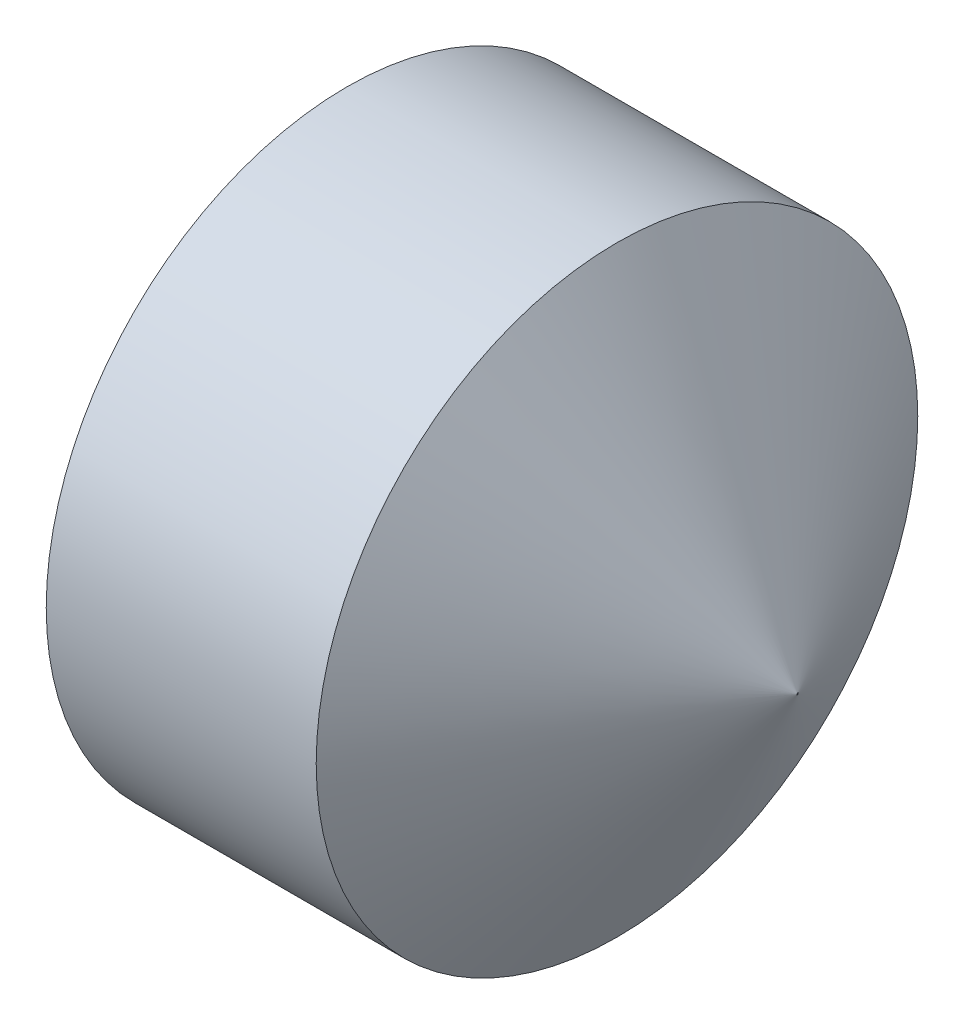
ISO-10303-21;
HEADER;
FILE_DESCRIPTION(('STEP AP214'),'2;1');
FILE_NAME('part.step','',(''),(''),'','','');
FILE_SCHEMA(('AUTOMOTIVE_DESIGN { 1 0 10303 214 1 1 1 1 }'));
ENDSEC;
DATA;
#1=APPLICATION_CONTEXT('core data for automotive mechanical design processes');
#2=APPLICATION_PROTOCOL_DEFINITION('international standard','automotive_design',2000,#1);
#3=PRODUCT_CONTEXT('',#1,'mechanical');
#4=PRODUCT('Part','Part','',(#3));
#5=PRODUCT_RELATED_PRODUCT_CATEGORY('part','',(#4));
#6=PRODUCT_DEFINITION_FORMATION('','',#4);
#7=PRODUCT_DEFINITION_CONTEXT('part definition',#1,'design');
#8=PRODUCT_DEFINITION('design','',#6,#7);
#9=PRODUCT_DEFINITION_SHAPE('','',#8);
#10=(LENGTH_UNIT() NAMED_UNIT(*) SI_UNIT(.MILLI.,.METRE.));
#11=(NAMED_UNIT(*) PLANE_ANGLE_UNIT() SI_UNIT($,.RADIAN.));
#12=(NAMED_UNIT(*) SI_UNIT($,.STERADIAN.) SOLID_ANGLE_UNIT());
#13=UNCERTAINTY_MEASURE_WITH_UNIT(LENGTH_MEASURE(1.E-05),#10,'distance_accuracy_value','');
#14=(GEOMETRIC_REPRESENTATION_CONTEXT(3) GLOBAL_UNCERTAINTY_ASSIGNED_CONTEXT((#13)) GLOBAL_UNIT_ASSIGNED_CONTEXT((#10,
#11,#12)) REPRESENTATION_CONTEXT('',''));
#15=CARTESIAN_POINT('',(0.,0.,0.));
#16=DIRECTION('',(0.,0.,1.));
#17=DIRECTION('',(1.,0.,0.));
#18=AXIS2_PLACEMENT_3D('',#15,#16,#17);
#19=CARTESIAN_POINT('',(0.,0.,0.));
#20=DIRECTION('',(-1.,0.,0.));
#21=DIRECTION('',(0.,0.,1.));
#22=AXIS2_PLACEMENT_3D('',#19,#20,#21);
#23=PLANE('',#22);
#24=CARTESIAN_POINT('',(0.,0.,0.));
#25=DIRECTION('',(-1.,0.,0.));
#26=DIRECTION('',(0.,0.,1.));
#27=AXIS2_PLACEMENT_3D('',#24,#25,#26);
#28=CIRCLE('',#27,2.055);
#29=CARTESIAN_POINT('',(0.,0.,2.055));
#30=VERTEX_POINT('',#29);
#31=EDGE_CURVE('E11',#30,#30,#28,.T.);
#32=ORIENTED_EDGE('',*,*,#31,.T.);
#33=EDGE_LOOP('',(#32));
#34=FACE_BOUND('',#33,.T.);
#35=DIRECTION('',(0.,0.,-1.));
#36=VECTOR('',#35,1.);
#37=CARTESIAN_POINT('',(0.,1.25,0.72168783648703));
#38=LINE('',#37,#36);
#39=CARTESIAN_POINT('',(0.,1.25,0.72168783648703));
#40=VERTEX_POINT('',#39);
#41=CARTESIAN_POINT('',(0.,1.25,-0.721687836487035));
#42=VERTEX_POINT('',#41);
#43=EDGE_CURVE('E124',#40,#42,#38,.T.);
#44=ORIENTED_EDGE('',*,*,#43,.F.);
#45=DIRECTION('',(0.,-0.866025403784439,0.5));
#46=VECTOR('',#45,1.);
#47=CARTESIAN_POINT('',(0.,1.25,0.72168783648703));
#48=LINE('',#47,#46);
#49=CARTESIAN_POINT('',(0.,0.,1.44337567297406));
#50=VERTEX_POINT('',#49);
#51=EDGE_CURVE('E46',#40,#50,#48,.T.);
#52=ORIENTED_EDGE('',*,*,#51,.T.);
#53=DIRECTION('',(0.,0.866025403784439,0.5));
#54=VECTOR('',#53,1.);
#55=CARTESIAN_POINT('',(0.,-1.25,0.72168783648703));
#56=LINE('',#55,#54);
#57=CARTESIAN_POINT('',(0.,-1.25,0.72168783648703));
#58=VERTEX_POINT('',#57);
#59=EDGE_CURVE('E115',#58,#50,#56,.T.);
#60=ORIENTED_EDGE('',*,*,#59,.F.);
#61=DIRECTION('',(0.,0.,-1.));
#62=VECTOR('',#61,1.);
#63=CARTESIAN_POINT('',(0.,-1.25,0.72168783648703));
#64=LINE('',#63,#62);
#65=CARTESIAN_POINT('',(0.,-1.25,-0.721687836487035));
#66=VERTEX_POINT('',#65);
#67=EDGE_CURVE('E118',#58,#66,#64,.T.);
#68=ORIENTED_EDGE('',*,*,#67,.T.);
#69=DIRECTION('',(0.,0.866025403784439,-0.5));
#70=VECTOR('',#69,1.);
#71=CARTESIAN_POINT('',(0.,-1.25,-0.721687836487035));
#72=LINE('',#71,#70);
#73=CARTESIAN_POINT('',(0.,0.,-1.44337567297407));
#74=VERTEX_POINT('',#73);
#75=EDGE_CURVE('E121',#66,#74,#72,.T.);
#76=ORIENTED_EDGE('',*,*,#75,.T.);
#77=DIRECTION('',(0.,-0.866025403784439,-0.5));
#78=VECTOR('',#77,1.);
#79=CARTESIAN_POINT('',(0.,1.25,-0.721687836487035));
#80=LINE('',#79,#78);
#81=EDGE_CURVE('E104',#42,#74,#80,.T.);
#82=ORIENTED_EDGE('',*,*,#81,.F.);
#83=EDGE_LOOP('',(#44,#52,#60,#68,#76,#82));
#84=FACE_BOUND('',#83,.T.);
#85=ADVANCED_FACE('F32',(#34,#84),#23,.T.);
#86=CARTESIAN_POINT('',(0.,0.,0.));
#87=DIRECTION('',(1.,0.,0.));
#88=DIRECTION('',(0.,0.,-1.));
#89=AXIS2_PLACEMENT_3D('',#86,#87,#88);
#90=CONICAL_SURFACE('',#89,2.055,1.0471975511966);
#91=CARTESIAN_POINT('',(0.256920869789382,0.,0.));
#92=DIRECTION('',(-1.,0.,0.));
#93=DIRECTION('',(0.,0.,1.));
#94=AXIS2_PLACEMENT_3D('',#91,#92,#93);
#95=CIRCLE('',#94,2.5);
#96=CARTESIAN_POINT('',(0.256920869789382,0.,2.5));
#97=VERTEX_POINT('',#96);
#98=EDGE_CURVE('E39',#97,#97,#95,.T.);
#99=ORIENTED_EDGE('',*,*,#98,.T.);
#100=EDGE_LOOP('',(#99));
#101=FACE_BOUND('',#100,.T.);
#102=ORIENTED_EDGE('',*,*,#31,.F.);
#103=EDGE_LOOP('',(#102));
#104=FACE_BOUND('',#103,.T.);
#105=ADVANCED_FACE('F141',(#101,#104),#90,.T.);
#106=CARTESIAN_POINT('',(-12.7,0.,0.));
#107=DIRECTION('',(-1.,0.,0.));
#108=DIRECTION('',(0.,0.,1.));
#109=AXIS2_PLACEMENT_3D('',#106,#107,#108);
#110=CYLINDRICAL_SURFACE('',#109,2.5);
#111=CARTESIAN_POINT('',(2.50085275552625,0.,0.));
#112=DIRECTION('',(-1.,0.,0.));
#113=DIRECTION('',(0.,0.,1.));
#114=AXIS2_PLACEMENT_3D('',#111,#112,#113);
#115=CIRCLE('',#114,2.5);
#116=CARTESIAN_POINT('',(2.50085275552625,0.,2.5));
#117=VERTEX_POINT('',#116);
#118=EDGE_CURVE('E136',#117,#117,#115,.T.);
#119=ORIENTED_EDGE('',*,*,#118,.T.);
#120=EDGE_LOOP('',(#119));
#121=FACE_BOUND('',#120,.T.);
#122=ORIENTED_EDGE('',*,*,#98,.F.);
#123=EDGE_LOOP('',(#122));
#124=FACE_BOUND('',#123,.T.);
#125=ADVANCED_FACE('F144',(#121,#124),#110,.T.);
#126=CARTESIAN_POINT('',(4.,0.,0.));
#127=DIRECTION('',(-1.,0.,0.));
#128=DIRECTION('',(0.,0.,1.));
#129=AXIS2_PLACEMENT_3D('',#126,#127,#128);
#130=CONICAL_SURFACE('',#129,0.0049999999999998,1.02974425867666);
#131=CARTESIAN_POINT('',(4.,0.,0.));
#132=DIRECTION('',(-1.,0.,0.));
#133=DIRECTION('',(0.,0.,1.));
#134=AXIS2_PLACEMENT_3D('',#131,#132,#133);
#135=CIRCLE('',#134,0.0049999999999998);
#136=CARTESIAN_POINT('',(4.,0.,0.00499999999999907));
#137=VERTEX_POINT('',#136);
#138=EDGE_CURVE('E133',#137,#137,#135,.T.);
#139=CARTESIAN_POINT('',(2.50085275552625,0.,2.5));
#140=CARTESIAN_POINT('',(2.51646887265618,0.,2.47401041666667));
#141=CARTESIAN_POINT('',(2.53208498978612,0.,2.44802083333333));
#142=CARTESIAN_POINT('',(2.56331722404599,0.,2.39604166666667));
#143=CARTESIAN_POINT('',(2.57893334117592,0.,2.37005208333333));
#144=CARTESIAN_POINT('',(2.61016557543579,0.,2.31807291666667));
#145=CARTESIAN_POINT('',(2.62578169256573,0.,2.29208333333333));
#146=CARTESIAN_POINT('',(2.6570139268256,0.,2.24010416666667));
#147=CARTESIAN_POINT('',(2.67263004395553,0.,2.21411458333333));
#148=CARTESIAN_POINT('',(2.7038622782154,0.,2.16213541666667));
#149=CARTESIAN_POINT('',(2.71947839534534,0.,2.13614583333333));
#150=CARTESIAN_POINT('',(2.75071062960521,0.,2.08416666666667));
#151=CARTESIAN_POINT('',(2.76632674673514,0.,2.05817708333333));
#152=CARTESIAN_POINT('',(2.79755898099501,0.,2.00619791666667));
#153=CARTESIAN_POINT('',(2.81317509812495,0.,1.98020833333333));
#154=CARTESIAN_POINT('',(2.84440733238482,0.,1.92822916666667));
#155=CARTESIAN_POINT('',(2.86002344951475,0.,1.90223958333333));
#156=CARTESIAN_POINT('',(2.89125568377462,0.,1.85026041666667));
#157=CARTESIAN_POINT('',(2.90687180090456,0.,1.82427083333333));
#158=CARTESIAN_POINT('',(2.93810403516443,0.,1.77229166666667));
#159=CARTESIAN_POINT('',(2.95372015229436,0.,1.74630208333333));
#160=CARTESIAN_POINT('',(2.98495238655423,0.,1.69432291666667));
#161=CARTESIAN_POINT('',(3.00056850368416,0.,1.66833333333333));
#162=CARTESIAN_POINT('',(3.03180073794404,0.,1.61635416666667));
#163=CARTESIAN_POINT('',(3.04741685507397,0.,1.59036458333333));
#164=CARTESIAN_POINT('',(3.07864908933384,0.,1.53838541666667));
#165=CARTESIAN_POINT('',(3.09426520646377,0.,1.51239583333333));
#166=CARTESIAN_POINT('',(3.12549744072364,0.,1.46041666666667));
#167=CARTESIAN_POINT('',(3.14111355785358,0.,1.43442708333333));
#168=CARTESIAN_POINT('',(3.17234579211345,0.,1.38244791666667));
#169=CARTESIAN_POINT('',(3.18796190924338,0.,1.35645833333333));
#170=CARTESIAN_POINT('',(3.21919414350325,0.,1.30447916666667));
#171=CARTESIAN_POINT('',(3.23481026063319,0.,1.27848958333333));
#172=CARTESIAN_POINT('',(3.26604249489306,0.,1.22651041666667));
#173=CARTESIAN_POINT('',(3.28165861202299,0.,1.20052083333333));
#174=CARTESIAN_POINT('',(3.31289084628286,0.,1.14854166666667));
#175=CARTESIAN_POINT('',(3.3285069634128,0.,1.12255208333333));
#176=CARTESIAN_POINT('',(3.35973919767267,0.,1.07057291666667));
#177=CARTESIAN_POINT('',(3.3753553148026,0.,1.04458333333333));
#178=CARTESIAN_POINT('',(3.40658754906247,0.,0.992604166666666));
#179=CARTESIAN_POINT('',(3.42220366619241,0.,0.966614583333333));
#180=CARTESIAN_POINT('',(3.45343590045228,0.,0.914635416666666));
#181=CARTESIAN_POINT('',(3.46905201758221,0.,0.888645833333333));
#182=CARTESIAN_POINT('',(3.50028425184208,0.,0.836666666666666));
#183=CARTESIAN_POINT('',(3.51590036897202,0.,0.810677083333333));
#184=CARTESIAN_POINT('',(3.54713260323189,0.,0.758697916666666));
#185=CARTESIAN_POINT('',(3.56274872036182,0.,0.732708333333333));
#186=CARTESIAN_POINT('',(3.59398095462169,0.,0.680729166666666));
#187=CARTESIAN_POINT('',(3.60959707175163,0.,0.654739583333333));
#188=CARTESIAN_POINT('',(3.6408293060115,0.,0.602760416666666));
#189=CARTESIAN_POINT('',(3.65644542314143,0.,0.576770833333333));
#190=CARTESIAN_POINT('',(3.6876776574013,0.,0.524791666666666));
#191=CARTESIAN_POINT('',(3.70329377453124,0.,0.498802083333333));
#192=CARTESIAN_POINT('',(3.73452600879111,0.,0.446822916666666));
#193=CARTESIAN_POINT('',(3.75014212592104,0.,0.420833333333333));
#194=CARTESIAN_POINT('',(3.78137436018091,0.,0.368854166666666));
#195=CARTESIAN_POINT('',(3.79699047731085,0.,0.342864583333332));
#196=CARTESIAN_POINT('',(3.82822271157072,0.,0.290885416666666));
#197=CARTESIAN_POINT('',(3.84383882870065,0.,0.264895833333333));
#198=CARTESIAN_POINT('',(3.87507106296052,0.,0.212916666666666));
#199=CARTESIAN_POINT('',(3.89068718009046,0.,0.186927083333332));
#200=CARTESIAN_POINT('',(3.92191941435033,0.,0.134947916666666));
#201=CARTESIAN_POINT('',(3.93753553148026,0.,0.108958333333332));
#202=CARTESIAN_POINT('',(3.96876776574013,0.,0.0569791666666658));
#203=CARTESIAN_POINT('',(3.98438388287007,0.,0.0309895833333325));
#204=CARTESIAN_POINT('',(4.,0.,0.00499999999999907));
#205=B_SPLINE_CURVE_WITH_KNOTS('',3,(#139,#140,#141,#142,#143,#144,#145,#146,#147,#148,#149,
#150,#151,#152,#153,#154,#155,#156,#157,#158,#159,#160,#161,#162,#163,#164,#165,#166,#167,#168,
#169,#170,#171,#172,#173,#174,#175,#176,#177,#178,#179,#180,#181,#182,#183,#184,#185,#186,#187,
#188,#189,#190,#191,#192,#193,#194,#195,#196,#197,#198,#199,#200,#201,#202,#203,#204),
.UNSPECIFIED.,.F.,.F.,(4,2,2,2,2,2,2,2,2,2,2,2,2,2,2,2,2,2,2,2,2,2,2,2,2,2,2,2,2,2,2,2,4),(0.,
0.0909609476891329,0.181921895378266,0.272882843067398,0.363843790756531,0.454804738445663,
0.545765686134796,0.636726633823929,0.727687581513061,0.818648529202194,0.909609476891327,
1.00057042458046,1.09153137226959,1.18249231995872,1.27345326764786,1.36441421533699,
1.45537516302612,1.54633611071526,1.63729705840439,1.72825800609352,1.81921895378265,
1.91017990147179,2.00114084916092,2.09210179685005,2.18306274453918,2.27402369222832,
2.36498463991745,2.45594558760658,2.54690653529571,2.63786748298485,2.72882843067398,
2.81978937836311,2.91075032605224),.UNSPECIFIED.);
#206=EDGE_CURVE('BSEAM146',#117,#137,#205,.T.);
#207=ORIENTED_EDGE('',*,*,#118,.F.);
#208=ORIENTED_EDGE('',*,*,#138,.T.);
#209=ORIENTED_EDGE('',*,*,#206,.T.);
#210=ORIENTED_EDGE('',*,*,#206,.F.);
#211=EDGE_LOOP('',(#207,#209,#208,#210));
#212=FACE_BOUND('',#211,.T.);
#213=ADVANCED_FACE('F146',(#212),#130,.T.);
#214=CARTESIAN_POINT('',(4.,0.,0.));
#215=DIRECTION('',(-1.,0.,0.));
#216=DIRECTION('',(0.,0.,1.));
#217=AXIS2_PLACEMENT_3D('',#214,#215,#216);
#218=PLANE('',#217);
#219=ORIENTED_EDGE('',*,*,#138,.F.);
#220=EDGE_LOOP('',(#219));
#221=FACE_BOUND('',#220,.T.);
#222=ADVANCED_FACE('F153',(#221),#218,.F.);
#223=CARTESIAN_POINT('',(1.2,1.25,0.72168783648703));
#224=DIRECTION('',(0.,-0.5,-0.866025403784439));
#225=DIRECTION('',(0.,0.866025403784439,-0.5));
#226=AXIS2_PLACEMENT_3D('',#223,#224,#225);
#227=PLANE('',#226);
#228=ORIENTED_EDGE('',*,*,#51,.F.);
#229=DIRECTION('',(-1.,0.,0.));
#230=VECTOR('',#229,1.);
#231=CARTESIAN_POINT('',(1.2,1.25,0.72168783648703));
#232=LINE('',#231,#230);
#233=CARTESIAN_POINT('',(1.2,1.25,0.72168783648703));
#234=VERTEX_POINT('',#233);
#235=EDGE_CURVE('E51',#234,#40,#232,.T.);
#236=ORIENTED_EDGE('',*,*,#235,.F.);
#237=DIRECTION('',(0.,-0.866025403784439,0.5));
#238=VECTOR('',#237,1.);
#239=CARTESIAN_POINT('',(1.2,1.25,0.72168783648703));
#240=LINE('',#239,#238);
#241=CARTESIAN_POINT('',(1.2,0.,1.44337567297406));
#242=VERTEX_POINT('',#241);
#243=EDGE_CURVE('E78',#234,#242,#240,.T.);
#244=ORIENTED_EDGE('',*,*,#243,.T.);
#245=DIRECTION('',(-1.,0.,0.));
#246=VECTOR('',#245,1.);
#247=CARTESIAN_POINT('',(1.2,0.,1.44337567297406));
#248=LINE('',#247,#246);
#249=EDGE_CURVE('E131',#242,#50,#248,.T.);
#250=ORIENTED_EDGE('',*,*,#249,.T.);
#251=EDGE_LOOP('',(#228,#236,#244,#250));
#252=FACE_BOUND('',#251,.T.);
#253=ADVANCED_FACE('F184',(#252),#227,.T.);
#254=CARTESIAN_POINT('',(1.2,-1.25,0.72168783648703));
#255=DIRECTION('',(0.,-0.5,0.866025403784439));
#256=DIRECTION('',(0.,-0.866025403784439,-0.5));
#257=AXIS2_PLACEMENT_3D('',#254,#255,#256);
#258=PLANE('',#257);
#259=ORIENTED_EDGE('',*,*,#59,.T.);
#260=ORIENTED_EDGE('',*,*,#249,.F.);
#261=DIRECTION('',(0.,0.866025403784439,0.5));
#262=VECTOR('',#261,1.);
#263=CARTESIAN_POINT('',(1.2,-1.25,0.72168783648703));
#264=LINE('',#263,#262);
#265=CARTESIAN_POINT('',(1.2,-1.25,0.72168783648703));
#266=VERTEX_POINT('',#265);
#267=EDGE_CURVE('E261',#266,#242,#264,.T.);
#268=ORIENTED_EDGE('',*,*,#267,.F.);
#269=DIRECTION('',(-1.,0.,0.));
#270=VECTOR('',#269,1.);
#271=CARTESIAN_POINT('',(1.2,-1.25,0.72168783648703));
#272=LINE('',#271,#270);
#273=EDGE_CURVE('E129',#266,#58,#272,.T.);
#274=ORIENTED_EDGE('',*,*,#273,.T.);
#275=EDGE_LOOP('',(#259,#260,#268,#274));
#276=FACE_BOUND('',#275,.T.);
#277=ADVANCED_FACE('F180',(#276),#258,.F.);
#278=CARTESIAN_POINT('',(1.2,-1.25,0.72168783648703));
#279=DIRECTION('',(0.,1.,0.));
#280=DIRECTION('',(0.,0.,1.));
#281=AXIS2_PLACEMENT_3D('',#278,#279,#280);
#282=PLANE('',#281);
#283=ORIENTED_EDGE('',*,*,#67,.F.);
#284=ORIENTED_EDGE('',*,*,#273,.F.);
#285=DIRECTION('',(0.,0.,-1.));
#286=VECTOR('',#285,1.);
#287=CARTESIAN_POINT('',(1.2,-1.25,0.72168783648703));
#288=LINE('',#287,#286);
#289=CARTESIAN_POINT('',(1.2,-1.25,-0.721687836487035));
#290=VERTEX_POINT('',#289);
#291=EDGE_CURVE('E99',#266,#290,#288,.T.);
#292=ORIENTED_EDGE('',*,*,#291,.T.);
#293=DIRECTION('',(-1.,0.,0.));
#294=VECTOR('',#293,1.);
#295=CARTESIAN_POINT('',(1.2,-1.25,-0.721687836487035));
#296=LINE('',#295,#294);
#297=EDGE_CURVE('E94',#290,#66,#296,.T.);
#298=ORIENTED_EDGE('',*,*,#297,.T.);
#299=EDGE_LOOP('',(#283,#284,#292,#298));
#300=FACE_BOUND('',#299,.T.);
#301=ADVANCED_FACE('F177',(#300),#282,.T.);
#302=CARTESIAN_POINT('',(1.2,-1.25,-0.721687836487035));
#303=DIRECTION('',(0.,0.5,0.866025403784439));
#304=DIRECTION('',(0.,-0.866025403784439,0.5));
#305=AXIS2_PLACEMENT_3D('',#302,#303,#304);
#306=PLANE('',#305);
#307=ORIENTED_EDGE('',*,*,#75,.F.);
#308=ORIENTED_EDGE('',*,*,#297,.F.);
#309=DIRECTION('',(0.,0.866025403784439,-0.5));
#310=VECTOR('',#309,1.);
#311=CARTESIAN_POINT('',(1.2,-1.25,-0.721687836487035));
#312=LINE('',#311,#310);
#313=CARTESIAN_POINT('',(1.2,0.,-1.44337567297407));
#314=VERTEX_POINT('',#313);
#315=EDGE_CURVE('E89',#290,#314,#312,.T.);
#316=ORIENTED_EDGE('',*,*,#315,.T.);
#317=DIRECTION('',(-1.,0.,0.));
#318=VECTOR('',#317,1.);
#319=CARTESIAN_POINT('',(1.2,0.,-1.44337567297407));
#320=LINE('',#319,#318);
#321=EDGE_CURVE('E93',#314,#74,#320,.T.);
#322=ORIENTED_EDGE('',*,*,#321,.T.);
#323=EDGE_LOOP('',(#307,#308,#316,#322));
#324=FACE_BOUND('',#323,.T.);
#325=ADVANCED_FACE('F92',(#324),#306,.T.);
#326=CARTESIAN_POINT('',(1.2,1.25,-0.721687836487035));
#327=DIRECTION('',(0.,0.5,-0.866025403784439));
#328=DIRECTION('',(0.,0.866025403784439,0.5));
#329=AXIS2_PLACEMENT_3D('',#326,#327,#328);
#330=PLANE('',#329);
#331=ORIENTED_EDGE('',*,*,#81,.T.);
#332=ORIENTED_EDGE('',*,*,#321,.F.);
#333=DIRECTION('',(0.,-0.866025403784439,-0.5));
#334=VECTOR('',#333,1.);
#335=CARTESIAN_POINT('',(1.2,1.25,-0.721687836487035));
#336=LINE('',#335,#334);
#337=CARTESIAN_POINT('',(1.2,1.25,-0.721687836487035));
#338=VERTEX_POINT('',#337);
#339=EDGE_CURVE('E98',#338,#314,#336,.T.);
#340=ORIENTED_EDGE('',*,*,#339,.F.);
#341=DIRECTION('',(-1.,0.,0.));
#342=VECTOR('',#341,1.);
#343=CARTESIAN_POINT('',(1.2,1.25,-0.721687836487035));
#344=LINE('',#343,#342);
#345=EDGE_CURVE('E74',#338,#42,#344,.T.);
#346=ORIENTED_EDGE('',*,*,#345,.T.);
#347=EDGE_LOOP('',(#331,#332,#340,#346));
#348=FACE_BOUND('',#347,.T.);
#349=ADVANCED_FACE('F101',(#348),#330,.F.);
#350=CARTESIAN_POINT('',(1.2,1.25,0.72168783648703));
#351=DIRECTION('',(0.,1.,0.));
#352=DIRECTION('',(0.,0.,1.));
#353=AXIS2_PLACEMENT_3D('',#350,#351,#352);
#354=PLANE('',#353);
#355=ORIENTED_EDGE('',*,*,#43,.T.);
#356=ORIENTED_EDGE('',*,*,#345,.F.);
#357=DIRECTION('',(0.,0.,-1.));
#358=VECTOR('',#357,1.);
#359=CARTESIAN_POINT('',(1.2,1.25,0.72168783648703));
#360=LINE('',#359,#358);
#361=EDGE_CURVE('E109',#234,#338,#360,.T.);
#362=ORIENTED_EDGE('',*,*,#361,.F.);
#363=ORIENTED_EDGE('',*,*,#235,.T.);
#364=EDGE_LOOP('',(#355,#356,#362,#363));
#365=FACE_BOUND('',#364,.T.);
#366=ADVANCED_FACE('F165',(#365),#354,.F.);
#367=CARTESIAN_POINT('',(1.2,1.25,0.72168783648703));
#368=DIRECTION('',(1.,0.,0.));
#369=DIRECTION('',(0.,0.,-1.));
#370=AXIS2_PLACEMENT_3D('',#367,#368,#369);
#371=PLANE('',#370);
#372=ORIENTED_EDGE('',*,*,#243,.F.);
#373=ORIENTED_EDGE('',*,*,#361,.T.);
#374=ORIENTED_EDGE('',*,*,#339,.T.);
#375=ORIENTED_EDGE('',*,*,#315,.F.);
#376=ORIENTED_EDGE('',*,*,#291,.F.);
#377=ORIENTED_EDGE('',*,*,#267,.T.);
#378=EDGE_LOOP('',(#372,#373,#374,#375,#376,#377));
#379=FACE_BOUND('',#378,.T.);
#380=ADVANCED_FACE('F107',(#379),#371,.F.);
#381=CLOSED_SHELL('',(#85,#105,#125,#213,#222,#253,#277,#301,#325,#349,#366,#380));
#382=MANIFOLD_SOLID_BREP('B2',#381);
#383=ADVANCED_BREP_SHAPE_REPRESENTATION('',(#18,#382),#14);
#384=SHAPE_DEFINITION_REPRESENTATION(#9,#383);
ENDSEC;
END-ISO-10303-21;
